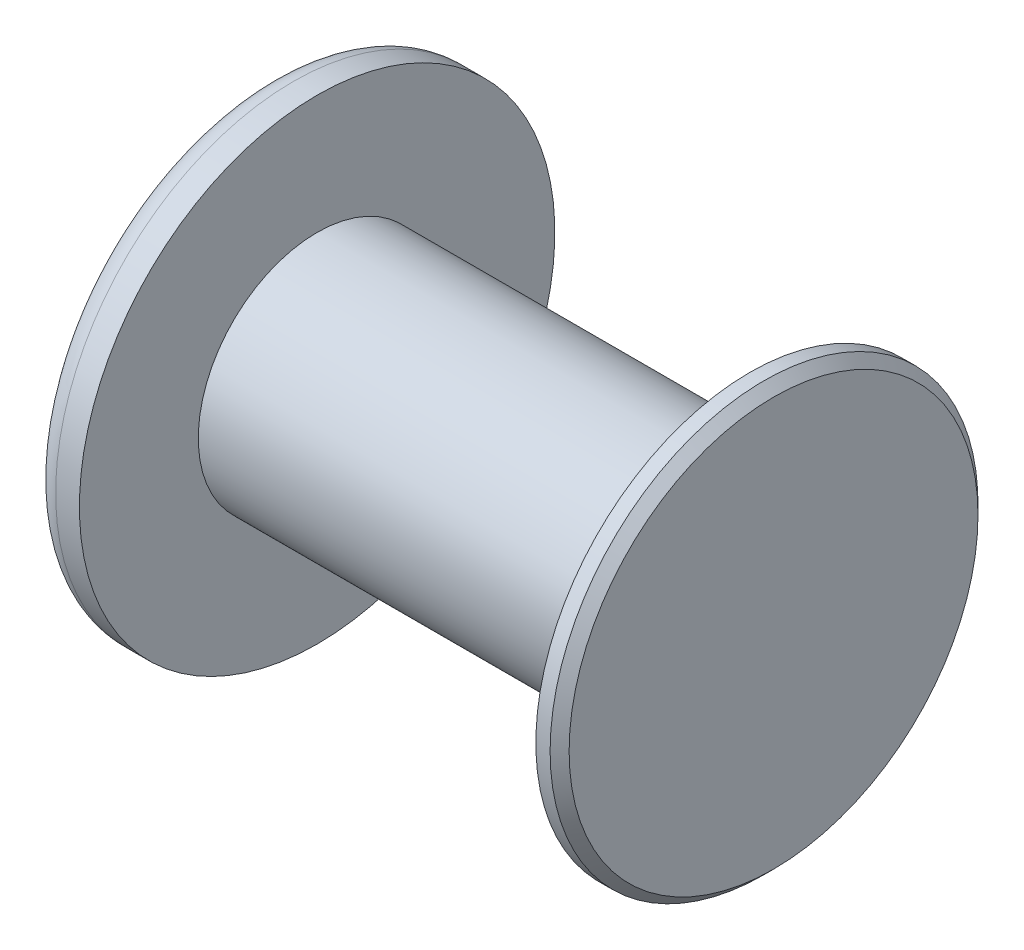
from build123d import *

# Parameters (mm, degrees)
CONG_1_R        = 0.5
CHANFREIN1_SIZE = 0.2


with BuildPart() as part:
    # Esquisse1 → R_volution1 (revolve)
    with BuildSketch(Plane.XY, mode=Mode.PRIVATE) as r_volution1_sk:
        Polygon((-5.3, 0), (-5.3, 5), (-4.3, 5), (-4.3, 2.5), (4.8, 2.5), (4.8, 4.5), (5.3, 4.5), (5.3, 0), align=None)
    revolve(r_volution1_sk.sketch.rotate(Axis((-5.3, 0, 0), (1, 0, 0)), 180), axis=Axis((-5.3, 0, 0), (1, 0, 0)))

    # Cong_1
    cong_1_edges = [part.edges().sort_by_distance(p)[0] for p in [
        (-5.3, 5, 0),
    ]]
    fillet(cong_1_edges, radius=CONG_1_R)

    # Chanfrein1
    chanfrein1_edges = [part.edges().sort_by_distance(p)[0] for p in [
        (5.3, 4.5, 0),
    ]]
    chamfer(chanfrein1_edges, length=CHANFREIN1_SIZE)


solid = part.part
